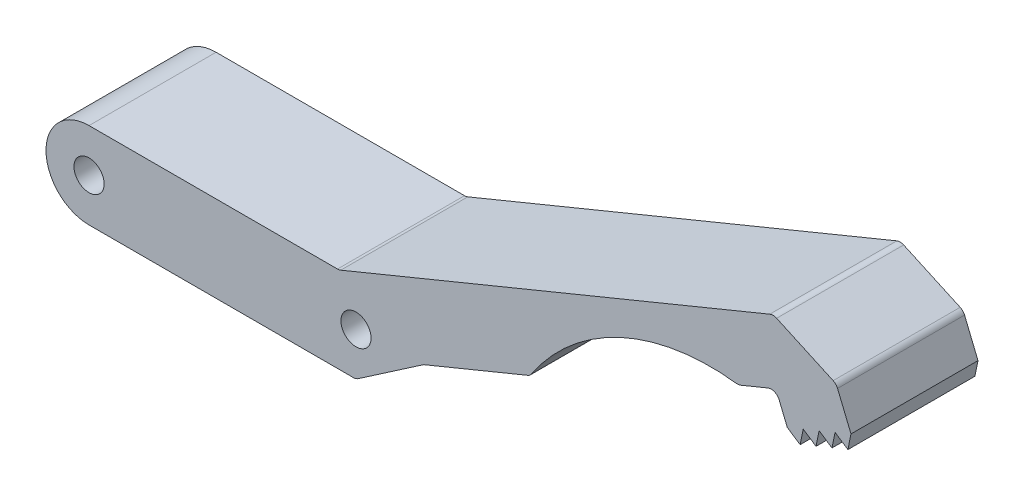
ISO-10303-21;
HEADER;
FILE_DESCRIPTION(('STEP AP214'),'2;1');
FILE_NAME('part.step','',(''),(''),'','','');
FILE_SCHEMA(('AUTOMOTIVE_DESIGN { 1 0 10303 214 1 1 1 1 }'));
ENDSEC;
DATA;
#1=APPLICATION_CONTEXT('core data for automotive mechanical design processes');
#2=APPLICATION_PROTOCOL_DEFINITION('international standard','automotive_design',2000,#1);
#3=PRODUCT_CONTEXT('',#1,'mechanical');
#4=PRODUCT('Part','Part','',(#3));
#5=PRODUCT_RELATED_PRODUCT_CATEGORY('part','',(#4));
#6=PRODUCT_DEFINITION_FORMATION('','',#4);
#7=PRODUCT_DEFINITION_CONTEXT('part definition',#1,'design');
#8=PRODUCT_DEFINITION('design','',#6,#7);
#9=PRODUCT_DEFINITION_SHAPE('','',#8);
#10=(LENGTH_UNIT() NAMED_UNIT(*) SI_UNIT(.MILLI.,.METRE.));
#11=(NAMED_UNIT(*) PLANE_ANGLE_UNIT() SI_UNIT($,.RADIAN.));
#12=(NAMED_UNIT(*) SI_UNIT($,.STERADIAN.) SOLID_ANGLE_UNIT());
#13=UNCERTAINTY_MEASURE_WITH_UNIT(LENGTH_MEASURE(1.E-05),#10,'distance_accuracy_value','');
#14=(GEOMETRIC_REPRESENTATION_CONTEXT(3) GLOBAL_UNCERTAINTY_ASSIGNED_CONTEXT((#13)) GLOBAL_UNIT_ASSIGNED_CONTEXT((#10,
#11,#12)) REPRESENTATION_CONTEXT('',''));
#15=CARTESIAN_POINT('',(0.,0.,0.));
#16=DIRECTION('',(0.,0.,1.));
#17=DIRECTION('',(1.,0.,0.));
#18=AXIS2_PLACEMENT_3D('',#15,#16,#17);
#19=CARTESIAN_POINT('',(4.18285581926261,-10.1735590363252,7.375));
#20=DIRECTION('',(0.380263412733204,-0.92487822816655,0.));
#21=DIRECTION('',(0.92487822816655,0.380263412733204,0.));
#22=AXIS2_PLACEMENT_3D('',#19,#20,#21);
#23=PLANE('',#22);
#24=DIRECTION('',(-0.92487822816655,-0.380263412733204,0.));
#25=VECTOR('',#24,1.);
#26=CARTESIAN_POINT('',(4.18285581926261,-10.1735590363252,-7.375));
#27=LINE('',#26,#25);
#28=CARTESIAN_POINT('',(41.9373455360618,5.34918835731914,-7.375));
#29=VERTEX_POINT('',#28);
#30=CARTESIAN_POINT('',(29.9516692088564,0.421281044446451,-7.375));
#31=VERTEX_POINT('',#30);
#32=EDGE_CURVE('E298',#29,#31,#27,.T.);
#33=ORIENTED_EDGE('',*,*,#32,.F.);
#34=DIRECTION('',(0.,0.,1.));
#35=VECTOR('',#34,1.);
#36=CARTESIAN_POINT('',(41.9373455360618,5.34918835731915,7.375));
#37=LINE('',#36,#35);
#38=CARTESIAN_POINT('',(41.9373455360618,5.34918835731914,7.375));
#39=VERTEX_POINT('',#38);
#40=EDGE_CURVE('E406',#29,#39,#37,.T.);
#41=ORIENTED_EDGE('',*,*,#40,.T.);
#42=DIRECTION('',(-0.92487822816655,-0.380263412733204,0.));
#43=VECTOR('',#42,1.);
#44=CARTESIAN_POINT('',(4.18285581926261,-10.1735590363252,7.375));
#45=LINE('',#44,#43);
#46=CARTESIAN_POINT('',(29.9516692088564,0.421281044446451,7.375));
#47=VERTEX_POINT('',#46);
#48=EDGE_CURVE('E446',#39,#47,#45,.T.);
#49=ORIENTED_EDGE('',*,*,#48,.T.);
#50=DIRECTION('',(0.,0.,-1.));
#51=VECTOR('',#50,1.);
#52=CARTESIAN_POINT('',(29.9516692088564,0.421281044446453,-7.375));
#53=LINE('',#52,#51);
#54=EDGE_CURVE('E403',#47,#31,#53,.T.);
#55=ORIENTED_EDGE('',*,*,#54,.T.);
#56=EDGE_LOOP('',(#33,#41,#49,#55));
#57=FACE_BOUND('',#56,.T.);
#58=ADVANCED_FACE('F41',(#57),#23,.T.);
#59=CARTESIAN_POINT('',(63.1527344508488,-8.10069108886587,7.375));
#60=DIRECTION('',(0.,0.,-1.));
#61=DIRECTION('',(-1.,0.,0.));
#62=AXIS2_PLACEMENT_3D('',#59,#60,#61);
#63=CYLINDRICAL_SURFACE('',#62,24.9423564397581);
#64=CARTESIAN_POINT('',(63.1527344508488,-8.10069108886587,-7.375));
#65=DIRECTION('',(0.,0.,1.));
#66=DIRECTION('',(1.,0.,0.));
#67=AXIS2_PLACEMENT_3D('',#64,#65,#66);
#68=CIRCLE('',#67,24.9423564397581);
#69=CARTESIAN_POINT('',(42.3895297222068,5.71996280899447,-7.375));
#70=VERTEX_POINT('',#69);
#71=CARTESIAN_POINT('',(66.1728326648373,16.6581487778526,-7.375));
#72=VERTEX_POINT('',#71);
#73=EDGE_CURVE('E301',#70,#72,#68,.F.);
#74=ORIENTED_EDGE('',*,*,#73,.T.);
#75=DIRECTION('',(0.,0.,-1.));
#76=VECTOR('',#75,1.);
#77=CARTESIAN_POINT('',(66.1728326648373,16.6581487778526,7.375));
#78=LINE('',#77,#76);
#79=CARTESIAN_POINT('',(66.1728326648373,16.6581487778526,7.375));
#80=VERTEX_POINT('',#79);
#81=EDGE_CURVE('E390',#72,#80,#78,.F.);
#82=ORIENTED_EDGE('',*,*,#81,.T.);
#83=CARTESIAN_POINT('',(63.1527344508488,-8.10069108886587,7.375));
#84=DIRECTION('',(0.,0.,1.));
#85=DIRECTION('',(1.,0.,0.));
#86=AXIS2_PLACEMENT_3D('',#83,#84,#85);
#87=CIRCLE('',#86,24.9423564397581);
#88=CARTESIAN_POINT('',(42.3895297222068,5.71996280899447,7.375));
#89=VERTEX_POINT('',#88);
#90=EDGE_CURVE('E251',#89,#80,#87,.F.);
#91=ORIENTED_EDGE('',*,*,#90,.F.);
#92=DIRECTION('',(0.,0.,-1.));
#93=VECTOR('',#92,1.);
#94=CARTESIAN_POINT('',(42.3895297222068,5.71996280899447,7.375));
#95=LINE('',#94,#93);
#96=EDGE_CURVE('E387',#89,#70,#95,.T.);
#97=ORIENTED_EDGE('',*,*,#96,.T.);
#98=EDGE_LOOP('',(#74,#82,#91,#97));
#99=FACE_BOUND('',#98,.T.);
#100=ADVANCED_FACE('F485',(#99),#63,.F.);
#101=CARTESIAN_POINT('',(3.75864457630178,-9.14179071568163,7.375));
#102=DIRECTION('',(0.380263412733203,-0.924878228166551,0.));
#103=DIRECTION('',(0.924878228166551,0.380263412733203,0.));
#104=AXIS2_PLACEMENT_3D('',#101,#102,#103);
#105=PLANE('',#104);
#106=DIRECTION('',(-0.924878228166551,-0.380263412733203,0.));
#107=VECTOR('',#106,1.);
#108=CARTESIAN_POINT('',(3.75864457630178,-9.14179071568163,7.375));
#109=LINE('',#108,#107);
#110=CARTESIAN_POINT('',(69.8366856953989,18.0261765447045,7.375));
#111=VERTEX_POINT('',#110);
#112=CARTESIAN_POINT('',(66.6741791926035,16.7259129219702,7.375));
#113=VERTEX_POINT('',#112);
#114=EDGE_CURVE('E248',#111,#113,#109,.T.);
#115=ORIENTED_EDGE('',*,*,#114,.T.);
#116=DIRECTION('',(0.,0.,1.));
#117=VECTOR('',#116,1.);
#118=CARTESIAN_POINT('',(66.6741791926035,16.7259129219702,-7.375));
#119=LINE('',#118,#117);
#120=CARTESIAN_POINT('',(66.6741791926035,16.7259129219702,-7.375));
#121=VERTEX_POINT('',#120);
#122=EDGE_CURVE('E374',#113,#121,#119,.F.);
#123=ORIENTED_EDGE('',*,*,#122,.T.);
#124=DIRECTION('',(-0.924878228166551,-0.380263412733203,0.));
#125=VECTOR('',#124,1.);
#126=CARTESIAN_POINT('',(3.75864457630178,-9.14179071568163,-7.375));
#127=LINE('',#126,#125);
#128=CARTESIAN_POINT('',(69.8366856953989,18.0261765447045,-7.375));
#129=VERTEX_POINT('',#128);
#130=EDGE_CURVE('E304',#129,#121,#127,.T.);
#131=ORIENTED_EDGE('',*,*,#130,.F.);
#132=DIRECTION('',(0.,0.,-1.));
#133=VECTOR('',#132,1.);
#134=CARTESIAN_POINT('',(69.8366856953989,18.0261765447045,7.375));
#135=LINE('',#134,#133);
#136=EDGE_CURVE('E233',#129,#111,#135,.F.);
#137=ORIENTED_EDGE('',*,*,#136,.T.);
#138=EDGE_LOOP('',(#115,#123,#131,#137));
#139=FACE_BOUND('',#138,.T.);
#140=ADVANCED_FACE('F490',(#139),#105,.T.);
#141=CARTESIAN_POINT('',(67.0029193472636,27.5482306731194,7.375));
#142=DIRECTION('',(-0.92487822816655,-0.380263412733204,0.));
#143=DIRECTION('',(0.380263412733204,-0.92487822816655,0.));
#144=AXIS2_PLACEMENT_3D('',#141,#142,#143);
#145=PLANE('',#144);
#146=DIRECTION('',(-0.380263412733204,0.92487822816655,0.));
#147=VECTOR('',#146,1.);
#148=CARTESIAN_POINT('',(67.0029193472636,27.5482306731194,7.375));
#149=LINE('',#148,#147);
#150=CARTESIAN_POINT('',(72.0850784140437,15.1873825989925,7.375));
#151=VERTEX_POINT('',#150);
#152=CARTESIAN_POINT('',(71.1418273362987,17.4815617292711,7.375));
#153=VERTEX_POINT('',#152);
#154=EDGE_CURVE('E226',#151,#153,#149,.T.);
#155=ORIENTED_EDGE('',*,*,#154,.T.);
#156=DIRECTION('',(0.,0.,-1.));
#157=VECTOR('',#156,1.);
#158=CARTESIAN_POINT('',(71.1418273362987,17.4815617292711,-7.375));
#159=LINE('',#158,#157);
#160=CARTESIAN_POINT('',(71.1418273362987,17.4815617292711,-7.375));
#161=VERTEX_POINT('',#160);
#162=EDGE_CURVE('E401',#153,#161,#159,.T.);
#163=ORIENTED_EDGE('',*,*,#162,.T.);
#164=DIRECTION('',(-0.380263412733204,0.92487822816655,0.));
#165=VECTOR('',#164,1.);
#166=CARTESIAN_POINT('',(67.0029193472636,27.5482306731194,-7.375));
#167=LINE('',#166,#165);
#168=CARTESIAN_POINT('',(72.0850784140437,15.1873825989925,-7.375));
#169=VERTEX_POINT('',#168);
#170=EDGE_CURVE('E229',#169,#161,#167,.T.);
#171=ORIENTED_EDGE('',*,*,#170,.F.);
#172=DIRECTION('',(0.,0.,-1.));
#173=VECTOR('',#172,1.);
#174=CARTESIAN_POINT('',(72.0850784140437,15.1873825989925,7.375));
#175=LINE('',#174,#173);
#176=EDGE_CURVE('E221',#151,#169,#175,.T.);
#177=ORIENTED_EDGE('',*,*,#176,.F.);
#178=EDGE_LOOP('',(#155,#163,#171,#177));
#179=FACE_BOUND('',#178,.T.);
#180=ADVANCED_FACE('F223',(#179),#145,.T.);
#181=CARTESIAN_POINT('',(29.2503710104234,43.795835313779,7.375));
#182=DIRECTION('',(0.555398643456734,0.831584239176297,0.));
#183=DIRECTION('',(-0.831584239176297,0.555398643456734,0.));
#184=AXIS2_PLACEMENT_3D('',#181,#182,#183);
#185=PLANE('',#184);
#186=DIRECTION('',(0.831584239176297,-0.555398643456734,0.));
#187=VECTOR('',#186,1.);
#188=CARTESIAN_POINT('',(29.2503710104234,43.795835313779,-7.375));
#189=LINE('',#188,#187);
#190=CARTESIAN_POINT('',(73.5755961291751,14.1918953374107,-7.375));
#191=VERTEX_POINT('',#190);
#192=EDGE_CURVE('E308',#169,#191,#189,.T.);
#193=ORIENTED_EDGE('',*,*,#192,.T.);
#194=DIRECTION('',(0.,0.,-1.));
#195=VECTOR('',#194,1.);
#196=CARTESIAN_POINT('',(73.5755961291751,14.1918953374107,7.375));
#197=LINE('',#196,#195);
#198=CARTESIAN_POINT('',(73.5755961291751,14.1918953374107,7.375));
#199=VERTEX_POINT('',#198);
#200=EDGE_CURVE('E234',#199,#191,#197,.T.);
#201=ORIENTED_EDGE('',*,*,#200,.F.);
#202=DIRECTION('',(0.831584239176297,-0.555398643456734,0.));
#203=VECTOR('',#202,1.);
#204=CARTESIAN_POINT('',(29.2503710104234,43.795835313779,7.375));
#205=LINE('',#204,#203);
#206=EDGE_CURVE('E238',#151,#199,#205,.T.);
#207=ORIENTED_EDGE('',*,*,#206,.F.);
#208=ORIENTED_EDGE('',*,*,#176,.T.);
#209=EDGE_LOOP('',(#193,#201,#207,#208));
#210=FACE_BOUND('',#209,.T.);
#211=ADVANCED_FACE('F239',(#210),#185,.F.);
#212=CARTESIAN_POINT('',(67.8333487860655,-13.8770907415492,7.375));
#213=DIRECTION('',(-0.979709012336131,0.200425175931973,0.));
#214=DIRECTION('',(-0.200425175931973,-0.979709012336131,0.));
#215=AXIS2_PLACEMENT_3D('',#212,#213,#214);
#216=PLANE('',#215);
#217=DIRECTION('',(0.200425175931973,0.979709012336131,0.));
#218=VECTOR('',#217,1.);
#219=CARTESIAN_POINT('',(67.8333487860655,-13.8770907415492,-7.375));
#220=LINE('',#219,#218);
#221=CARTESIAN_POINT('',(73.9348348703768,15.9479094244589,-7.375));
#222=VERTEX_POINT('',#221);
#223=EDGE_CURVE('E310',#191,#222,#220,.T.);
#224=ORIENTED_EDGE('',*,*,#223,.T.);
#225=DIRECTION('',(0.,0.,-1.));
#226=VECTOR('',#225,1.);
#227=CARTESIAN_POINT('',(73.9348348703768,15.9479094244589,7.375));
#228=LINE('',#227,#226);
#229=CARTESIAN_POINT('',(73.9348348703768,15.9479094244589,7.375));
#230=VERTEX_POINT('',#229);
#231=EDGE_CURVE('E370',#230,#222,#228,.T.);
#232=ORIENTED_EDGE('',*,*,#231,.F.);
#233=DIRECTION('',(0.200425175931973,0.979709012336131,0.));
#234=VECTOR('',#233,1.);
#235=CARTESIAN_POINT('',(67.8333487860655,-13.8770907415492,7.375));
#236=LINE('',#235,#234);
#237=EDGE_CURVE('E241',#199,#230,#236,.T.);
#238=ORIENTED_EDGE('',*,*,#237,.F.);
#239=ORIENTED_EDGE('',*,*,#200,.T.);
#240=EDGE_LOOP('',(#224,#232,#238,#239));
#241=FACE_BOUND('',#240,.T.);
#242=ADVANCED_FACE('F581',(#241),#216,.F.);
#243=CARTESIAN_POINT('',(30.1722185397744,45.1760941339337,7.375));
#244=DIRECTION('',(-0.555398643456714,-0.83158423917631,0.));
#245=DIRECTION('',(0.83158423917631,-0.555398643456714,0.));
#246=AXIS2_PLACEMENT_3D('',#243,#244,#245);
#247=PLANE('',#246);
#248=DIRECTION('',(-0.83158423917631,0.555398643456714,0.));
#249=VECTOR('',#248,1.);
#250=CARTESIAN_POINT('',(30.1722185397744,45.1760941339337,-7.375));
#251=LINE('',#250,#249);
#252=CARTESIAN_POINT('',(75.4253525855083,14.9524221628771,-7.375));
#253=VERTEX_POINT('',#252);
#254=EDGE_CURVE('E313',#253,#222,#251,.T.);
#255=ORIENTED_EDGE('',*,*,#254,.F.);
#256=DIRECTION('',(0.,0.,-1.));
#257=VECTOR('',#256,1.);
#258=CARTESIAN_POINT('',(75.4253525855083,14.9524221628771,7.375));
#259=LINE('',#258,#257);
#260=CARTESIAN_POINT('',(75.4253525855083,14.9524221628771,7.375));
#261=VERTEX_POINT('',#260);
#262=EDGE_CURVE('E368',#261,#253,#259,.T.);
#263=ORIENTED_EDGE('',*,*,#262,.F.);
#264=DIRECTION('',(-0.83158423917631,0.555398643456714,0.));
#265=VECTOR('',#264,1.);
#266=CARTESIAN_POINT('',(30.1722185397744,45.1760941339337,7.375));
#267=LINE('',#266,#265);
#268=EDGE_CURVE('E256',#261,#230,#267,.T.);
#269=ORIENTED_EDGE('',*,*,#268,.T.);
#270=ORIENTED_EDGE('',*,*,#231,.T.);
#271=EDGE_LOOP('',(#255,#263,#269,#270));
#272=FACE_BOUND('',#271,.T.);
#273=ADVANCED_FACE('F578',(#272),#247,.T.);
#274=CARTESIAN_POINT('',(69.4594642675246,-14.209755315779,7.375));
#275=DIRECTION('',(0.979709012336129,-0.200425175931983,0.));
#276=DIRECTION('',(0.200425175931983,0.979709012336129,0.));
#277=AXIS2_PLACEMENT_3D('',#274,#275,#276);
#278=PLANE('',#277);
#279=DIRECTION('',(-0.200425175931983,-0.979709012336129,0.));
#280=VECTOR('',#279,1.);
#281=CARTESIAN_POINT('',(69.4594642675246,-14.209755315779,-7.375));
#282=LINE('',#281,#280);
#283=CARTESIAN_POINT('',(75.78459132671,16.7084362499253,-7.375));
#284=VERTEX_POINT('',#283);
#285=EDGE_CURVE('E316',#284,#253,#282,.T.);
#286=ORIENTED_EDGE('',*,*,#285,.F.);
#287=DIRECTION('',(0.,0.,-1.));
#288=VECTOR('',#287,1.);
#289=CARTESIAN_POINT('',(75.78459132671,16.7084362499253,7.375));
#290=LINE('',#289,#288);
#291=CARTESIAN_POINT('',(75.78459132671,16.7084362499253,7.375));
#292=VERTEX_POINT('',#291);
#293=EDGE_CURVE('E366',#292,#284,#290,.T.);
#294=ORIENTED_EDGE('',*,*,#293,.F.);
#295=DIRECTION('',(-0.200425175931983,-0.979709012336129,0.));
#296=VECTOR('',#295,1.);
#297=CARTESIAN_POINT('',(69.4594642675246,-14.209755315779,7.375));
#298=LINE('',#297,#296);
#299=EDGE_CURVE('E259',#292,#261,#298,.T.);
#300=ORIENTED_EDGE('',*,*,#299,.T.);
#301=ORIENTED_EDGE('',*,*,#262,.T.);
#302=EDGE_LOOP('',(#286,#294,#300,#301));
#303=FACE_BOUND('',#302,.T.);
#304=ADVANCED_FACE('F573',(#303),#278,.T.);
#305=CARTESIAN_POINT('',(31.0940660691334,46.5563529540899,7.375));
#306=DIRECTION('',(0.555398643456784,0.831584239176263,0.));
#307=DIRECTION('',(-0.831584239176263,0.555398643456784,0.));
#308=AXIS2_PLACEMENT_3D('',#305,#306,#307);
#309=PLANE('',#308);
#310=DIRECTION('',(0.831584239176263,-0.555398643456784,0.));
#311=VECTOR('',#310,1.);
#312=CARTESIAN_POINT('',(31.0940660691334,46.5563529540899,-7.375));
#313=LINE('',#312,#311);
#314=CARTESIAN_POINT('',(77.2751090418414,15.7129489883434,-7.375));
#315=VERTEX_POINT('',#314);
#316=EDGE_CURVE('E319',#284,#315,#313,.T.);
#317=ORIENTED_EDGE('',*,*,#316,.T.);
#318=DIRECTION('',(0.,0.,-1.));
#319=VECTOR('',#318,1.);
#320=CARTESIAN_POINT('',(77.2751090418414,15.7129489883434,7.375));
#321=LINE('',#320,#319);
#322=CARTESIAN_POINT('',(77.2751090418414,15.7129489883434,7.375));
#323=VERTEX_POINT('',#322);
#324=EDGE_CURVE('E363',#323,#315,#321,.T.);
#325=ORIENTED_EDGE('',*,*,#324,.F.);
#326=DIRECTION('',(0.831584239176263,-0.555398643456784,0.));
#327=VECTOR('',#326,1.);
#328=CARTESIAN_POINT('',(31.0940660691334,46.5563529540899,7.375));
#329=LINE('',#328,#327);
#330=EDGE_CURVE('E262',#292,#323,#329,.T.);
#331=ORIENTED_EDGE('',*,*,#330,.F.);
#332=ORIENTED_EDGE('',*,*,#293,.T.);
#333=EDGE_LOOP('',(#317,#325,#331,#332));
#334=FACE_BOUND('',#333,.T.);
#335=ADVANCED_FACE('F570',(#334),#309,.F.);
#336=CARTESIAN_POINT('',(71.0855797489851,-14.5424198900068,7.375));
#337=DIRECTION('',(-0.979709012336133,0.200425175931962,0.));
#338=DIRECTION('',(-0.200425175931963,-0.979709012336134,0.));
#339=AXIS2_PLACEMENT_3D('',#336,#337,#338);
#340=PLANE('',#339);
#341=DIRECTION('',(0.200425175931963,0.979709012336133,0.));
#342=VECTOR('',#341,1.);
#343=CARTESIAN_POINT('',(71.0855797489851,-14.5424198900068,-7.375));
#344=LINE('',#343,#342);
#345=CARTESIAN_POINT('',(77.6343477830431,17.4689630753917,-7.375));
#346=VERTEX_POINT('',#345);
#347=EDGE_CURVE('E322',#315,#346,#344,.T.);
#348=ORIENTED_EDGE('',*,*,#347,.T.);
#349=DIRECTION('',(0.,0.,-1.));
#350=VECTOR('',#349,1.);
#351=CARTESIAN_POINT('',(77.6343477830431,17.4689630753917,7.375));
#352=LINE('',#351,#350);
#353=CARTESIAN_POINT('',(77.6343477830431,17.4689630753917,7.375));
#354=VERTEX_POINT('',#353);
#355=EDGE_CURVE('E361',#354,#346,#352,.T.);
#356=ORIENTED_EDGE('',*,*,#355,.F.);
#357=DIRECTION('',(0.200425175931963,0.979709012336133,0.));
#358=VECTOR('',#357,1.);
#359=CARTESIAN_POINT('',(71.0855797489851,-14.5424198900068,7.375));
#360=LINE('',#359,#358);
#361=EDGE_CURVE('E265',#323,#354,#360,.T.);
#362=ORIENTED_EDGE('',*,*,#361,.F.);
#363=ORIENTED_EDGE('',*,*,#324,.T.);
#364=EDGE_LOOP('',(#348,#356,#362,#363));
#365=FACE_BOUND('',#364,.T.);
#366=ADVANCED_FACE('F566',(#365),#340,.F.);
#367=CARTESIAN_POINT('',(32.0159135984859,47.9366117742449,7.375));
#368=DIRECTION('',(-0.555398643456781,-0.831584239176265,0.));
#369=DIRECTION('',(0.831584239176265,-0.555398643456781,0.));
#370=AXIS2_PLACEMENT_3D('',#367,#368,#369);
#371=PLANE('',#370);
#372=DIRECTION('',(-0.831584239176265,0.555398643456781,0.));
#373=VECTOR('',#372,1.);
#374=CARTESIAN_POINT('',(32.0159135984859,47.9366117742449,-7.375));
#375=LINE('',#374,#373);
#376=CARTESIAN_POINT('',(79.1248654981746,16.4734758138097,-7.375));
#377=VERTEX_POINT('',#376);
#378=EDGE_CURVE('E325',#377,#346,#375,.T.);
#379=ORIENTED_EDGE('',*,*,#378,.F.);
#380=DIRECTION('',(0.,0.,-1.));
#381=VECTOR('',#380,1.);
#382=CARTESIAN_POINT('',(79.1248654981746,16.4734758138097,7.375));
#383=LINE('',#382,#381);
#384=CARTESIAN_POINT('',(79.1248654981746,16.4734758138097,7.375));
#385=VERTEX_POINT('',#384);
#386=EDGE_CURVE('E359',#385,#377,#383,.T.);
#387=ORIENTED_EDGE('',*,*,#386,.F.);
#388=DIRECTION('',(-0.831584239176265,0.555398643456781,0.));
#389=VECTOR('',#388,1.);
#390=CARTESIAN_POINT('',(32.0159135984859,47.9366117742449,7.375));
#391=LINE('',#390,#389);
#392=EDGE_CURVE('E267',#385,#354,#391,.T.);
#393=ORIENTED_EDGE('',*,*,#392,.T.);
#394=ORIENTED_EDGE('',*,*,#355,.T.);
#395=EDGE_LOOP('',(#379,#387,#393,#394));
#396=FACE_BOUND('',#395,.T.);
#397=ADVANCED_FACE('F562',(#396),#371,.T.);
#398=CARTESIAN_POINT('',(72.7116952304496,-14.8750844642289,7.375));
#399=DIRECTION('',(0.979709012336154,-0.200425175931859,0.));
#400=DIRECTION('',(0.200425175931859,0.979709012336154,0.));
#401=AXIS2_PLACEMENT_3D('',#398,#399,#400);
#402=PLANE('',#401);
#403=DIRECTION('',(-0.200425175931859,-0.979709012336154,0.));
#404=VECTOR('',#403,1.);
#405=CARTESIAN_POINT('',(72.7116952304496,-14.8750844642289,-7.375));
#406=LINE('',#405,#404);
#407=CARTESIAN_POINT('',(79.4841042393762,18.2294899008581,-7.375));
#408=VERTEX_POINT('',#407);
#409=EDGE_CURVE('E328',#408,#377,#406,.T.);
#410=ORIENTED_EDGE('',*,*,#409,.F.);
#411=DIRECTION('',(0.,0.,-1.));
#412=VECTOR('',#411,1.);
#413=CARTESIAN_POINT('',(79.4841042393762,18.2294899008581,7.375));
#414=LINE('',#413,#412);
#415=CARTESIAN_POINT('',(79.4841042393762,18.2294899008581,7.375));
#416=VERTEX_POINT('',#415);
#417=EDGE_CURVE('E356',#416,#408,#414,.T.);
#418=ORIENTED_EDGE('',*,*,#417,.F.);
#419=DIRECTION('',(-0.200425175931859,-0.979709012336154,0.));
#420=VECTOR('',#419,1.);
#421=CARTESIAN_POINT('',(72.7116952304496,-14.8750844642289,7.375));
#422=LINE('',#421,#420);
#423=EDGE_CURVE('E270',#416,#385,#422,.T.);
#424=ORIENTED_EDGE('',*,*,#423,.T.);
#425=ORIENTED_EDGE('',*,*,#386,.T.);
#426=EDGE_LOOP('',(#410,#418,#424,#425));
#427=FACE_BOUND('',#426,.T.);
#428=ADVANCED_FACE('F558',(#427),#402,.T.);
#429=CARTESIAN_POINT('',(74.4019451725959,30.5903379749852,7.375));
#430=DIRECTION('',(0.924878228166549,0.380263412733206,0.));
#431=DIRECTION('',(-0.380263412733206,0.924878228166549,0.));
#432=AXIS2_PLACEMENT_3D('',#429,#430,#431);
#433=PLANE('',#432);
#434=DIRECTION('',(0.380263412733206,-0.924878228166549,0.));
#435=VECTOR('',#434,1.);
#436=CARTESIAN_POINT('',(74.4019451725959,30.5903379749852,-7.375));
#437=LINE('',#436,#435);
#438=CARTESIAN_POINT('',(77.9233252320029,22.0256229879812,-7.375));
#439=VERTEX_POINT('',#438);
#440=EDGE_CURVE('E331',#439,#408,#437,.T.);
#441=ORIENTED_EDGE('',*,*,#440,.F.);
#442=DIRECTION('',(0.,0.,-1.));
#443=VECTOR('',#442,1.);
#444=CARTESIAN_POINT('',(77.9233252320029,22.0256229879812,7.375));
#445=LINE('',#444,#443);
#446=CARTESIAN_POINT('',(77.9233252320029,22.0256229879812,7.375));
#447=VERTEX_POINT('',#446);
#448=EDGE_CURVE('E421',#439,#447,#445,.F.);
#449=ORIENTED_EDGE('',*,*,#448,.T.);
#450=DIRECTION('',(0.380263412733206,-0.924878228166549,0.));
#451=VECTOR('',#450,1.);
#452=CARTESIAN_POINT('',(74.4019451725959,30.5903379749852,7.375));
#453=LINE('',#452,#451);
#454=EDGE_CURVE('E273',#447,#416,#453,.T.);
#455=ORIENTED_EDGE('',*,*,#454,.T.);
#456=ORIENTED_EDGE('',*,*,#417,.T.);
#457=EDGE_LOOP('',(#441,#449,#455,#456));
#458=FACE_BOUND('',#457,.T.);
#459=ADVANCED_FACE('F552',(#458),#433,.T.);
#460=CARTESIAN_POINT('',(21.8103769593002,47.8823439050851,7.375));
#461=DIRECTION('',(0.414522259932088,0.910039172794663,0.));
#462=DIRECTION('',(-0.910039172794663,0.414522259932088,0.));
#463=AXIS2_PLACEMENT_3D('',#460,#461,#462);
#464=PLANE('',#463);
#465=DIRECTION('',(0.910039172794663,-0.414522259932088,0.));
#466=VECTOR('',#465,1.);
#467=CARTESIAN_POINT('',(21.8103769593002,47.8823439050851,7.375));
#468=LINE('',#467,#466);
#469=CARTESIAN_POINT('',(70.8500425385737,25.54480766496,7.375));
#470=VERTEX_POINT('',#469);
#471=CARTESIAN_POINT('',(77.4129692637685,22.5553987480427,7.375));
#472=VERTEX_POINT('',#471);
#473=EDGE_CURVE('E275',#470,#472,#468,.T.);
#474=ORIENTED_EDGE('',*,*,#473,.T.);
#475=DIRECTION('',(0.,0.,-1.));
#476=VECTOR('',#475,1.);
#477=CARTESIAN_POINT('',(77.4129692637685,22.5553987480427,7.375));
#478=LINE('',#477,#476);
#479=CARTESIAN_POINT('',(77.4129692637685,22.5553987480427,-7.375));
#480=VERTEX_POINT('',#479);
#481=EDGE_CURVE('E418',#472,#480,#478,.T.);
#482=ORIENTED_EDGE('',*,*,#481,.T.);
#483=DIRECTION('',(0.910039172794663,-0.414522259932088,0.));
#484=VECTOR('',#483,1.);
#485=CARTESIAN_POINT('',(21.8103769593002,47.8823439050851,-7.375));
#486=LINE('',#485,#484);
#487=CARTESIAN_POINT('',(70.8500425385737,25.54480766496,-7.375));
#488=VERTEX_POINT('',#487);
#489=EDGE_CURVE('E333',#488,#480,#486,.T.);
#490=ORIENTED_EDGE('',*,*,#489,.F.);
#491=DIRECTION('',(0.,0.,-1.));
#492=VECTOR('',#491,1.);
#493=CARTESIAN_POINT('',(70.8500425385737,25.54480766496,7.375));
#494=LINE('',#493,#492);
#495=EDGE_CURVE('E416',#488,#470,#494,.F.);
#496=ORIENTED_EDGE('',*,*,#495,.T.);
#497=EDGE_LOOP('',(#474,#482,#490,#496));
#498=FACE_BOUND('',#497,.T.);
#499=ADVANCED_FACE('F545',(#498),#464,.T.);
#500=CARTESIAN_POINT('',(1.14074851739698,-2.7745332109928,7.375));
#501=DIRECTION('',(-0.380263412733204,0.92487822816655,0.));
#502=DIRECTION('',(-0.92487822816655,-0.380263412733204,0.));
#503=AXIS2_PLACEMENT_3D('',#500,#501,#502);
#504=PLANE('',#503);
#505=DIRECTION('',(0.92487822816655,0.380263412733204,0.));
#506=VECTOR('',#505,1.);
#507=CARTESIAN_POINT('',(1.14074851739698,-2.7745332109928,-7.375));
#508=LINE('',#507,#506);
#509=CARTESIAN_POINT('',(20.2327114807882,5.07512177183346,-7.375));
#510=VERTEX_POINT('',#509);
#511=CARTESIAN_POINT('',(70.0552568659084,25.5596467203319,-7.375));
#512=VERTEX_POINT('',#511);
#513=EDGE_CURVE('E336',#510,#512,#508,.T.);
#514=ORIENTED_EDGE('',*,*,#513,.F.);
#515=DIRECTION('',(0.,0.,-1.));
#516=VECTOR('',#515,1.);
#517=CARTESIAN_POINT('',(20.2327114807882,5.07512177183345,7.375));
#518=LINE('',#517,#516);
#519=CARTESIAN_POINT('',(20.2327114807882,5.07512177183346,7.375));
#520=VERTEX_POINT('',#519);
#521=EDGE_CURVE('E414',#510,#520,#518,.F.);
#522=ORIENTED_EDGE('',*,*,#521,.T.);
#523=DIRECTION('',(0.92487822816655,0.380263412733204,0.));
#524=VECTOR('',#523,1.);
#525=CARTESIAN_POINT('',(1.14074851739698,-2.7745332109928,7.375));
#526=LINE('',#525,#524);
#527=CARTESIAN_POINT('',(70.0552568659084,25.5596467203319,7.375));
#528=VERTEX_POINT('',#527);
#529=EDGE_CURVE('E278',#520,#528,#526,.T.);
#530=ORIENTED_EDGE('',*,*,#529,.T.);
#531=DIRECTION('',(0.,0.,-1.));
#532=VECTOR('',#531,1.);
#533=CARTESIAN_POINT('',(70.0552568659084,25.5596467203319,7.375));
#534=LINE('',#533,#532);
#535=EDGE_CURVE('E411',#528,#512,#534,.T.);
#536=ORIENTED_EDGE('',*,*,#535,.T.);
#537=EDGE_LOOP('',(#514,#522,#530,#536));
#538=FACE_BOUND('',#537,.T.);
#539=ADVANCED_FACE('F538',(#538),#504,.T.);
#540=CARTESIAN_POINT('',(0.,5.,7.375));
#541=DIRECTION('',(0.,1.,0.));
#542=DIRECTION('',(-1.,0.,0.));
#543=AXIS2_PLACEMENT_3D('',#540,#541,#542);
#544=PLANE('',#543);
#545=DIRECTION('',(1.,0.,0.));
#546=VECTOR('',#545,1.);
#547=CARTESIAN_POINT('',(0.,5.,7.375));
#548=LINE('',#547,#546);
#549=CARTESIAN_POINT('',(-9.,5.,7.375));
#550=VERTEX_POINT('',#549);
#551=CARTESIAN_POINT('',(19.852448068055,5.,7.375));
#552=VERTEX_POINT('',#551);
#553=EDGE_CURVE('E281',#550,#552,#548,.T.);
#554=ORIENTED_EDGE('',*,*,#553,.T.);
#555=DIRECTION('',(0.,0.,-1.));
#556=VECTOR('',#555,1.);
#557=CARTESIAN_POINT('',(19.852448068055,5.,-7.375));
#558=LINE('',#557,#556);
#559=CARTESIAN_POINT('',(19.852448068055,5.,-7.375));
#560=VERTEX_POINT('',#559);
#561=EDGE_CURVE('E408',#552,#560,#558,.T.);
#562=ORIENTED_EDGE('',*,*,#561,.T.);
#563=DIRECTION('',(1.,0.,0.));
#564=VECTOR('',#563,1.);
#565=CARTESIAN_POINT('',(0.,5.,-7.375));
#566=LINE('',#565,#564);
#567=CARTESIAN_POINT('',(-9.,5.,-7.375));
#568=VERTEX_POINT('',#567);
#569=EDGE_CURVE('E339',#568,#560,#566,.T.);
#570=ORIENTED_EDGE('',*,*,#569,.F.);
#571=DIRECTION('',(0.,0.,-1.));
#572=VECTOR('',#571,1.);
#573=CARTESIAN_POINT('',(-9.,5.,7.375));
#574=LINE('',#573,#572);
#575=EDGE_CURVE('E354',#550,#568,#574,.T.);
#576=ORIENTED_EDGE('',*,*,#575,.F.);
#577=EDGE_LOOP('',(#554,#562,#570,#576));
#578=FACE_BOUND('',#577,.T.);
#579=ADVANCED_FACE('F531',(#578),#544,.T.);
#580=CARTESIAN_POINT('',(-9.,0.,7.375));
#581=DIRECTION('',(0.,0.,-1.));
#582=DIRECTION('',(-1.,0.,0.));
#583=AXIS2_PLACEMENT_3D('',#580,#581,#582);
#584=CYLINDRICAL_SURFACE('',#583,5.);
#585=CARTESIAN_POINT('',(-9.,0.,-7.375));
#586=DIRECTION('',(0.,0.,1.));
#587=DIRECTION('',(1.,0.,0.));
#588=AXIS2_PLACEMENT_3D('',#585,#586,#587);
#589=CIRCLE('',#588,5.);
#590=CARTESIAN_POINT('',(-9.,-5.,-7.375));
#591=VERTEX_POINT('',#590);
#592=EDGE_CURVE('E342',#568,#591,#589,.T.);
#593=ORIENTED_EDGE('',*,*,#592,.T.);
#594=DIRECTION('',(0.,0.,-1.));
#595=VECTOR('',#594,1.);
#596=CARTESIAN_POINT('',(-9.,-5.,7.375));
#597=LINE('',#596,#595);
#598=CARTESIAN_POINT('',(-9.,-5.,7.375));
#599=VERTEX_POINT('',#598);
#600=EDGE_CURVE('E291',#599,#591,#597,.T.);
#601=ORIENTED_EDGE('',*,*,#600,.F.);
#602=CARTESIAN_POINT('',(-9.,0.,7.375));
#603=DIRECTION('',(0.,0.,1.));
#604=DIRECTION('',(1.,0.,0.));
#605=AXIS2_PLACEMENT_3D('',#602,#603,#604);
#606=CIRCLE('',#605,5.);
#607=EDGE_CURVE('E284',#550,#599,#606,.T.);
#608=ORIENTED_EDGE('',*,*,#607,.F.);
#609=ORIENTED_EDGE('',*,*,#575,.T.);
#610=EDGE_LOOP('',(#593,#601,#608,#609));
#611=FACE_BOUND('',#610,.T.);
#612=ADVANCED_FACE('F528',(#611),#584,.T.);
#613=CARTESIAN_POINT('',(0.,-5.,7.375));
#614=DIRECTION('',(0.,1.,0.));
#615=DIRECTION('',(-1.,0.,0.));
#616=AXIS2_PLACEMENT_3D('',#613,#614,#615);
#617=PLANE('',#616);
#618=DIRECTION('',(1.,0.,0.));
#619=VECTOR('',#618,1.);
#620=CARTESIAN_POINT('',(0.,-5.,-7.375));
#621=LINE('',#620,#619);
#622=CARTESIAN_POINT('',(21.6902867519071,-5.,-7.375));
#623=VERTEX_POINT('',#622);
#624=EDGE_CURVE('E345',#591,#623,#621,.T.);
#625=ORIENTED_EDGE('',*,*,#624,.T.);
#626=DIRECTION('',(0.,0.,-1.));
#627=VECTOR('',#626,1.);
#628=CARTESIAN_POINT('',(21.6902867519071,-5.,7.375));
#629=LINE('',#628,#627);
#630=CARTESIAN_POINT('',(21.6902867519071,-5.,7.375));
#631=VERTEX_POINT('',#630);
#632=EDGE_CURVE('E427',#623,#631,#629,.F.);
#633=ORIENTED_EDGE('',*,*,#632,.T.);
#634=DIRECTION('',(1.,0.,0.));
#635=VECTOR('',#634,1.);
#636=CARTESIAN_POINT('',(0.,-5.,7.375));
#637=LINE('',#636,#635);
#638=EDGE_CURVE('E287',#599,#631,#637,.T.);
#639=ORIENTED_EDGE('',*,*,#638,.F.);
#640=ORIENTED_EDGE('',*,*,#600,.T.);
#641=EDGE_LOOP('',(#625,#633,#639,#640));
#642=FACE_BOUND('',#641,.T.);
#643=ADVANCED_FACE('F469',(#642),#617,.F.);
#644=CARTESIAN_POINT('',(22.,0.,7.375));
#645=DIRECTION('',(0.,0.,-1.));
#646=DIRECTION('',(-1.,0.,0.));
#647=AXIS2_PLACEMENT_3D('',#644,#645,#646);
#648=CYLINDRICAL_SURFACE('',#647,1.75);
#649=CARTESIAN_POINT('',(22.,0.,7.375));
#650=DIRECTION('',(0.,0.,1.));
#651=DIRECTION('',(1.,0.,0.));
#652=AXIS2_PLACEMENT_3D('',#649,#650,#651);
#653=CIRCLE('',#652,1.75);
#654=CARTESIAN_POINT('',(23.75,0.,7.375));
#655=VERTEX_POINT('',#654);
#656=EDGE_CURVE('E450',#655,#655,#653,.T.);
#657=ORIENTED_EDGE('',*,*,#656,.T.);
#658=EDGE_LOOP('',(#657));
#659=FACE_BOUND('',#658,.T.);
#660=CARTESIAN_POINT('',(22.,0.,-7.375));
#661=DIRECTION('',(0.,0.,1.));
#662=DIRECTION('',(1.,0.,0.));
#663=AXIS2_PLACEMENT_3D('',#660,#661,#662);
#664=CIRCLE('',#663,1.75);
#665=CARTESIAN_POINT('',(23.75,0.,-7.375));
#666=VERTEX_POINT('',#665);
#667=EDGE_CURVE('E295',#666,#666,#664,.T.);
#668=ORIENTED_EDGE('',*,*,#667,.F.);
#669=EDGE_LOOP('',(#668));
#670=FACE_BOUND('',#669,.T.);
#671=ADVANCED_FACE('F466',(#659,#670),#648,.F.);
#672=CARTESIAN_POINT('',(-9.,0.,7.375));
#673=DIRECTION('',(0.,0.,-1.));
#674=DIRECTION('',(-1.,0.,0.));
#675=AXIS2_PLACEMENT_3D('',#672,#673,#674);
#676=CYLINDRICAL_SURFACE('',#675,1.75);
#677=CARTESIAN_POINT('',(-9.,0.,7.375));
#678=DIRECTION('',(0.,0.,1.));
#679=DIRECTION('',(1.,0.,0.));
#680=AXIS2_PLACEMENT_3D('',#677,#678,#679);
#681=CIRCLE('',#680,1.75);
#682=CARTESIAN_POINT('',(-7.25,0.,7.375));
#683=VERTEX_POINT('',#682);
#684=EDGE_CURVE('E351',#683,#683,#681,.T.);
#685=ORIENTED_EDGE('',*,*,#684,.T.);
#686=EDGE_LOOP('',(#685));
#687=FACE_BOUND('',#686,.T.);
#688=CARTESIAN_POINT('',(-9.,0.,-7.375));
#689=DIRECTION('',(0.,0.,1.));
#690=DIRECTION('',(1.,0.,0.));
#691=AXIS2_PLACEMENT_3D('',#688,#689,#690);
#692=CIRCLE('',#691,1.75);
#693=CARTESIAN_POINT('',(-7.25,0.,-7.375));
#694=VERTEX_POINT('',#693);
#695=EDGE_CURVE('E292',#694,#694,#692,.T.);
#696=ORIENTED_EDGE('',*,*,#695,.F.);
#697=EDGE_LOOP('',(#696));
#698=FACE_BOUND('',#697,.T.);
#699=ADVANCED_FACE('F458',(#687,#698),#676,.F.);
#700=CARTESIAN_POINT('',(9.35951951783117,-13.6605924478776,7.375));
#701=DIRECTION('',(0.565210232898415,-0.824946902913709,0.));
#702=DIRECTION('',(0.824946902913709,0.565210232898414,0.));
#703=AXIS2_PLACEMENT_3D('',#700,#701,#702);
#704=PLANE('',#703);
#705=DIRECTION('',(-0.824946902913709,-0.565210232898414,0.));
#706=VECTOR('',#705,1.);
#707=CARTESIAN_POINT('',(9.35951951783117,-13.6605924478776,-7.375));
#708=LINE('',#707,#706);
#709=CARTESIAN_POINT('',(29.7667223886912,0.321349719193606,-7.375));
#710=VERTEX_POINT('',#709);
#711=CARTESIAN_POINT('',(22.2554969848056,-4.82494690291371,-7.375));
#712=VERTEX_POINT('',#711);
#713=EDGE_CURVE('E348',#710,#712,#708,.T.);
#714=ORIENTED_EDGE('',*,*,#713,.F.);
#715=DIRECTION('',(0.,0.,-1.));
#716=VECTOR('',#715,1.);
#717=CARTESIAN_POINT('',(29.7667223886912,0.321349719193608,7.375));
#718=LINE('',#717,#716);
#719=CARTESIAN_POINT('',(29.7667223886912,0.321349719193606,7.375));
#720=VERTEX_POINT('',#719);
#721=EDGE_CURVE('E63',#710,#720,#718,.F.);
#722=ORIENTED_EDGE('',*,*,#721,.T.);
#723=DIRECTION('',(-0.824946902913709,-0.565210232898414,0.));
#724=VECTOR('',#723,1.);
#725=CARTESIAN_POINT('',(9.35951951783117,-13.6605924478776,7.375));
#726=LINE('',#725,#724);
#727=CARTESIAN_POINT('',(22.2554969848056,-4.82494690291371,7.375));
#728=VERTEX_POINT('',#727);
#729=EDGE_CURVE('E289',#720,#728,#726,.T.);
#730=ORIENTED_EDGE('',*,*,#729,.T.);
#731=DIRECTION('',(0.,0.,-1.));
#732=VECTOR('',#731,1.);
#733=CARTESIAN_POINT('',(22.2554969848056,-4.82494690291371,-7.375));
#734=LINE('',#733,#732);
#735=EDGE_CURVE('E423',#728,#712,#734,.T.);
#736=ORIENTED_EDGE('',*,*,#735,.T.);
#737=EDGE_LOOP('',(#714,#722,#730,#736));
#738=FACE_BOUND('',#737,.T.);
#739=ADVANCED_FACE('F440',(#738),#704,.T.);
#740=CARTESIAN_POINT('',(0.,0.,7.375));
#741=DIRECTION('',(0.,0.,1.));
#742=DIRECTION('',(1.,0.,0.));
#743=AXIS2_PLACEMENT_3D('',#740,#741,#742);
#744=PLANE('',#743);
#745=ORIENTED_EDGE('',*,*,#684,.F.);
#746=EDGE_LOOP('',(#745));
#747=FACE_BOUND('',#746,.T.);
#748=ORIENTED_EDGE('',*,*,#656,.F.);
#749=EDGE_LOOP('',(#748));
#750=FACE_BOUND('',#749,.T.);
#751=ORIENTED_EDGE('',*,*,#90,.T.);
#752=CARTESIAN_POINT('',(66.2939157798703,17.6507911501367,7.375));
#753=DIRECTION('',(0.,0.,1.));
#754=DIRECTION('',(1.,0.,0.));
#755=AXIS2_PLACEMENT_3D('',#752,#753,#754);
#756=CIRCLE('',#755,1.);
#757=EDGE_CURVE('E399',#80,#113,#756,.T.);
#758=ORIENTED_EDGE('',*,*,#757,.T.);
#759=ORIENTED_EDGE('',*,*,#114,.F.);
#760=CARTESIAN_POINT('',(70.2169491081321,17.1012983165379,7.375));
#761=DIRECTION('',(0.,0.,1.));
#762=DIRECTION('',(1.,0.,0.));
#763=AXIS2_PLACEMENT_3D('',#760,#761,#762);
#764=CIRCLE('',#763,1.);
#765=EDGE_CURVE('E247',#111,#153,#764,.F.);
#766=ORIENTED_EDGE('',*,*,#765,.T.);
#767=ORIENTED_EDGE('',*,*,#154,.F.);
#768=ORIENTED_EDGE('',*,*,#206,.T.);
#769=ORIENTED_EDGE('',*,*,#237,.T.);
#770=ORIENTED_EDGE('',*,*,#268,.F.);
#771=ORIENTED_EDGE('',*,*,#299,.F.);
#772=ORIENTED_EDGE('',*,*,#330,.T.);
#773=ORIENTED_EDGE('',*,*,#361,.T.);
#774=ORIENTED_EDGE('',*,*,#392,.F.);
#775=ORIENTED_EDGE('',*,*,#423,.F.);
#776=ORIENTED_EDGE('',*,*,#454,.F.);
#777=CARTESIAN_POINT('',(76.9984470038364,21.645359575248,7.375));
#778=DIRECTION('',(0.,0.,1.));
#779=DIRECTION('',(1.,0.,0.));
#780=AXIS2_PLACEMENT_3D('',#777,#778,#779);
#781=CIRCLE('',#780,1.);
#782=EDGE_CURVE('E395',#447,#472,#781,.T.);
#783=ORIENTED_EDGE('',*,*,#782,.T.);
#784=ORIENTED_EDGE('',*,*,#473,.F.);
#785=CARTESIAN_POINT('',(70.4355202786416,24.6347684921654,7.375));
#786=DIRECTION('',(0.,0.,1.));
#787=DIRECTION('',(1.,0.,0.));
#788=AXIS2_PLACEMENT_3D('',#785,#786,#787);
#789=CIRCLE('',#788,1.);
#790=EDGE_CURVE('E393',#470,#528,#789,.T.);
#791=ORIENTED_EDGE('',*,*,#790,.T.);
#792=ORIENTED_EDGE('',*,*,#529,.F.);
#793=CARTESIAN_POINT('',(19.852448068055,6.,7.375));
#794=DIRECTION('',(0.,0.,1.));
#795=DIRECTION('',(1.,0.,0.));
#796=AXIS2_PLACEMENT_3D('',#793,#794,#795);
#797=CIRCLE('',#796,1.);
#798=EDGE_CURVE('E434',#520,#552,#797,.F.);
#799=ORIENTED_EDGE('',*,*,#798,.T.);
#800=ORIENTED_EDGE('',*,*,#553,.F.);
#801=ORIENTED_EDGE('',*,*,#607,.T.);
#802=ORIENTED_EDGE('',*,*,#638,.T.);
#803=CARTESIAN_POINT('',(21.6902867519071,-4.,7.375));
#804=DIRECTION('',(0.,0.,1.));
#805=DIRECTION('',(1.,0.,0.));
#806=AXIS2_PLACEMENT_3D('',#803,#804,#805);
#807=CIRCLE('',#806,1.);
#808=EDGE_CURVE('E56',#631,#728,#807,.T.);
#809=ORIENTED_EDGE('',*,*,#808,.T.);
#810=ORIENTED_EDGE('',*,*,#729,.F.);
#811=CARTESIAN_POINT('',(30.3319326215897,-0.503597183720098,7.375));
#812=DIRECTION('',(0.,0.,1.));
#813=DIRECTION('',(1.,0.,0.));
#814=AXIS2_PLACEMENT_3D('',#811,#812,#813);
#815=CIRCLE('',#814,1.);
#816=EDGE_CURVE('E11',#720,#47,#815,.F.);
#817=ORIENTED_EDGE('',*,*,#816,.T.);
#818=ORIENTED_EDGE('',*,*,#48,.F.);
#819=CARTESIAN_POINT('',(41.5570821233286,6.2740665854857,7.375));
#820=DIRECTION('',(0.,0.,1.));
#821=DIRECTION('',(1.,0.,0.));
#822=AXIS2_PLACEMENT_3D('',#819,#820,#821);
#823=CIRCLE('',#822,1.);
#824=EDGE_CURVE('E397',#39,#89,#823,.T.);
#825=ORIENTED_EDGE('',*,*,#824,.T.);
#826=EDGE_LOOP('',(#751,#758,#759,#766,#767,#768,#769,#770,#771,#772,#773,#774,#775,#776,#783,
#784,#791,#792,#799,#800,#801,#802,#809,#810,#817,#818,#825));
#827=FACE_BOUND('',#826,.T.);
#828=ADVANCED_FACE('F244',(#747,#750,#827),#744,.T.);
#829=CARTESIAN_POINT('',(0.,0.,-7.375));
#830=DIRECTION('',(0.,0.,1.));
#831=DIRECTION('',(1.,0.,0.));
#832=AXIS2_PLACEMENT_3D('',#829,#830,#831);
#833=PLANE('',#832);
#834=ORIENTED_EDGE('',*,*,#695,.T.);
#835=EDGE_LOOP('',(#834));
#836=FACE_BOUND('',#835,.T.);
#837=ORIENTED_EDGE('',*,*,#667,.T.);
#838=EDGE_LOOP('',(#837));
#839=FACE_BOUND('',#838,.T.);
#840=ORIENTED_EDGE('',*,*,#130,.T.);
#841=CARTESIAN_POINT('',(66.2939157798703,17.6507911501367,-7.375));
#842=DIRECTION('',(0.,0.,1.));
#843=DIRECTION('',(1.,0.,0.));
#844=AXIS2_PLACEMENT_3D('',#841,#842,#843);
#845=CIRCLE('',#844,1.);
#846=EDGE_CURVE('E385',#121,#72,#845,.F.);
#847=ORIENTED_EDGE('',*,*,#846,.T.);
#848=ORIENTED_EDGE('',*,*,#73,.F.);
#849=CARTESIAN_POINT('',(41.5570821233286,6.2740665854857,-7.375));
#850=DIRECTION('',(0.,0.,1.));
#851=DIRECTION('',(1.,0.,0.));
#852=AXIS2_PLACEMENT_3D('',#849,#850,#851);
#853=CIRCLE('',#852,1.);
#854=EDGE_CURVE('E383',#70,#29,#853,.F.);
#855=ORIENTED_EDGE('',*,*,#854,.T.);
#856=ORIENTED_EDGE('',*,*,#32,.T.);
#857=CARTESIAN_POINT('',(30.3319326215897,-0.503597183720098,-7.375));
#858=DIRECTION('',(0.,0.,1.));
#859=DIRECTION('',(1.,0.,0.));
#860=AXIS2_PLACEMENT_3D('',#857,#858,#859);
#861=CIRCLE('',#860,1.);
#862=EDGE_CURVE('E49',#31,#710,#861,.T.);
#863=ORIENTED_EDGE('',*,*,#862,.T.);
#864=ORIENTED_EDGE('',*,*,#713,.T.);
#865=CARTESIAN_POINT('',(21.6902867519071,-4.,-7.375));
#866=DIRECTION('',(0.,0.,1.));
#867=DIRECTION('',(1.,0.,0.));
#868=AXIS2_PLACEMENT_3D('',#865,#866,#867);
#869=CIRCLE('',#868,1.);
#870=EDGE_CURVE('E377',#712,#623,#869,.F.);
#871=ORIENTED_EDGE('',*,*,#870,.T.);
#872=ORIENTED_EDGE('',*,*,#624,.F.);
#873=ORIENTED_EDGE('',*,*,#592,.F.);
#874=ORIENTED_EDGE('',*,*,#569,.T.);
#875=CARTESIAN_POINT('',(19.852448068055,6.,-7.375));
#876=DIRECTION('',(0.,0.,1.));
#877=DIRECTION('',(1.,0.,0.));
#878=AXIS2_PLACEMENT_3D('',#875,#876,#877);
#879=CIRCLE('',#878,1.);
#880=EDGE_CURVE('E432',#560,#510,#879,.T.);
#881=ORIENTED_EDGE('',*,*,#880,.T.);
#882=ORIENTED_EDGE('',*,*,#513,.T.);
#883=CARTESIAN_POINT('',(70.4355202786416,24.6347684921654,-7.375));
#884=DIRECTION('',(0.,0.,1.));
#885=DIRECTION('',(1.,0.,0.));
#886=AXIS2_PLACEMENT_3D('',#883,#884,#885);
#887=CIRCLE('',#886,1.);
#888=EDGE_CURVE('E379',#512,#488,#887,.F.);
#889=ORIENTED_EDGE('',*,*,#888,.T.);
#890=ORIENTED_EDGE('',*,*,#489,.T.);
#891=CARTESIAN_POINT('',(76.9984470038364,21.645359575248,-7.375));
#892=DIRECTION('',(0.,0.,1.));
#893=DIRECTION('',(1.,0.,0.));
#894=AXIS2_PLACEMENT_3D('',#891,#892,#893);
#895=CIRCLE('',#894,1.);
#896=EDGE_CURVE('E381',#480,#439,#895,.F.);
#897=ORIENTED_EDGE('',*,*,#896,.T.);
#898=ORIENTED_EDGE('',*,*,#440,.T.);
#899=ORIENTED_EDGE('',*,*,#409,.T.);
#900=ORIENTED_EDGE('',*,*,#378,.T.);
#901=ORIENTED_EDGE('',*,*,#347,.F.);
#902=ORIENTED_EDGE('',*,*,#316,.F.);
#903=ORIENTED_EDGE('',*,*,#285,.T.);
#904=ORIENTED_EDGE('',*,*,#254,.T.);
#905=ORIENTED_EDGE('',*,*,#223,.F.);
#906=ORIENTED_EDGE('',*,*,#192,.F.);
#907=ORIENTED_EDGE('',*,*,#170,.T.);
#908=CARTESIAN_POINT('',(70.2169491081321,17.1012983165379,-7.375));
#909=DIRECTION('',(0.,0.,1.));
#910=DIRECTION('',(1.,0.,0.));
#911=AXIS2_PLACEMENT_3D('',#908,#909,#910);
#912=CIRCLE('',#911,1.);
#913=EDGE_CURVE('E429',#161,#129,#912,.T.);
#914=ORIENTED_EDGE('',*,*,#913,.T.);
#915=EDGE_LOOP('',(#840,#847,#848,#855,#856,#863,#864,#871,#872,#873,#874,#881,#882,#889,#890,
#897,#898,#899,#900,#901,#902,#903,#904,#905,#906,#907,#914));
#916=FACE_BOUND('',#915,.T.);
#917=ADVANCED_FACE('F436',(#836,#839,#916),#833,.F.);
#918=CARTESIAN_POINT('',(66.2939157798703,17.6507911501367,7.375));
#919=DIRECTION('',(0.,0.,-1.));
#920=DIRECTION('',(-1.,0.,0.));
#921=AXIS2_PLACEMENT_3D('',#918,#919,#920);
#922=CYLINDRICAL_SURFACE('',#921,1.);
#923=ORIENTED_EDGE('',*,*,#757,.F.);
#924=ORIENTED_EDGE('',*,*,#81,.F.);
#925=ORIENTED_EDGE('',*,*,#846,.F.);
#926=ORIENTED_EDGE('',*,*,#122,.F.);
#927=EDGE_LOOP('',(#923,#924,#925,#926));
#928=FACE_BOUND('',#927,.T.);
#929=ADVANCED_FACE('F474',(#928),#922,.T.);
#930=CARTESIAN_POINT('',(70.2169491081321,17.1012983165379,7.375));
#931=DIRECTION('',(0.,0.,1.));
#932=DIRECTION('',(1.,0.,0.));
#933=AXIS2_PLACEMENT_3D('',#930,#931,#932);
#934=CYLINDRICAL_SURFACE('',#933,1.);
#935=ORIENTED_EDGE('',*,*,#765,.F.);
#936=ORIENTED_EDGE('',*,*,#136,.F.);
#937=ORIENTED_EDGE('',*,*,#913,.F.);
#938=ORIENTED_EDGE('',*,*,#162,.F.);
#939=EDGE_LOOP('',(#935,#936,#937,#938));
#940=FACE_BOUND('',#939,.T.);
#941=ADVANCED_FACE('F480',(#940),#934,.F.);
#942=CARTESIAN_POINT('',(41.5570821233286,6.2740665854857,7.375));
#943=DIRECTION('',(0.,0.,-1.));
#944=DIRECTION('',(-1.,0.,0.));
#945=AXIS2_PLACEMENT_3D('',#942,#943,#944);
#946=CYLINDRICAL_SURFACE('',#945,1.);
#947=ORIENTED_EDGE('',*,*,#824,.F.);
#948=ORIENTED_EDGE('',*,*,#40,.F.);
#949=ORIENTED_EDGE('',*,*,#854,.F.);
#950=ORIENTED_EDGE('',*,*,#96,.F.);
#951=EDGE_LOOP('',(#947,#948,#949,#950));
#952=FACE_BOUND('',#951,.T.);
#953=ADVANCED_FACE('F499',(#952),#946,.T.);
#954=CARTESIAN_POINT('',(19.852448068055,6.,7.375));
#955=DIRECTION('',(0.,0.,1.));
#956=DIRECTION('',(1.,0.,0.));
#957=AXIS2_PLACEMENT_3D('',#954,#955,#956);
#958=CYLINDRICAL_SURFACE('',#957,1.);
#959=ORIENTED_EDGE('',*,*,#798,.F.);
#960=ORIENTED_EDGE('',*,*,#521,.F.);
#961=ORIENTED_EDGE('',*,*,#880,.F.);
#962=ORIENTED_EDGE('',*,*,#561,.F.);
#963=EDGE_LOOP('',(#959,#960,#961,#962));
#964=FACE_BOUND('',#963,.T.);
#965=ADVANCED_FACE('F503',(#964),#958,.F.);
#966=CARTESIAN_POINT('',(76.9984470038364,21.645359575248,7.375));
#967=DIRECTION('',(0.,0.,-1.));
#968=DIRECTION('',(-1.,0.,0.));
#969=AXIS2_PLACEMENT_3D('',#966,#967,#968);
#970=CYLINDRICAL_SURFACE('',#969,1.);
#971=ORIENTED_EDGE('',*,*,#782,.F.);
#972=ORIENTED_EDGE('',*,*,#448,.F.);
#973=ORIENTED_EDGE('',*,*,#896,.F.);
#974=ORIENTED_EDGE('',*,*,#481,.F.);
#975=EDGE_LOOP('',(#971,#972,#973,#974));
#976=FACE_BOUND('',#975,.T.);
#977=ADVANCED_FACE('F507',(#976),#970,.T.);
#978=CARTESIAN_POINT('',(70.4355202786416,24.6347684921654,7.375));
#979=DIRECTION('',(0.,0.,-1.));
#980=DIRECTION('',(-1.,0.,0.));
#981=AXIS2_PLACEMENT_3D('',#978,#979,#980);
#982=CYLINDRICAL_SURFACE('',#981,1.);
#983=ORIENTED_EDGE('',*,*,#790,.F.);
#984=ORIENTED_EDGE('',*,*,#495,.F.);
#985=ORIENTED_EDGE('',*,*,#888,.F.);
#986=ORIENTED_EDGE('',*,*,#535,.F.);
#987=EDGE_LOOP('',(#983,#984,#985,#986));
#988=FACE_BOUND('',#987,.T.);
#989=ADVANCED_FACE('F511',(#988),#982,.T.);
#990=CARTESIAN_POINT('',(30.3319326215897,-0.503597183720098,7.375));
#991=DIRECTION('',(0.,0.,1.));
#992=DIRECTION('',(1.,0.,0.));
#993=AXIS2_PLACEMENT_3D('',#990,#991,#992);
#994=CYLINDRICAL_SURFACE('',#993,1.);
#995=ORIENTED_EDGE('',*,*,#816,.F.);
#996=ORIENTED_EDGE('',*,*,#721,.F.);
#997=ORIENTED_EDGE('',*,*,#862,.F.);
#998=ORIENTED_EDGE('',*,*,#54,.F.);
#999=EDGE_LOOP('',(#995,#996,#997,#998));
#1000=FACE_BOUND('',#999,.T.);
#1001=ADVANCED_FACE('F443',(#1000),#994,.F.);
#1002=CARTESIAN_POINT('',(21.6902867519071,-4.,7.375));
#1003=DIRECTION('',(0.,0.,1.));
#1004=DIRECTION('',(1.,0.,0.));
#1005=AXIS2_PLACEMENT_3D('',#1002,#1003,#1004);
#1006=CYLINDRICAL_SURFACE('',#1005,1.);
#1007=ORIENTED_EDGE('',*,*,#808,.F.);
#1008=ORIENTED_EDGE('',*,*,#632,.F.);
#1009=ORIENTED_EDGE('',*,*,#870,.F.);
#1010=ORIENTED_EDGE('',*,*,#735,.F.);
#1011=EDGE_LOOP('',(#1007,#1008,#1009,#1010));
#1012=FACE_BOUND('',#1011,.T.);
#1013=ADVANCED_FACE('F43',(#1012),#1006,.T.);
#1014=CLOSED_SHELL('',(#58,#100,#140,#180,#211,#242,#273,#304,#335,#366,#397,#428,#459,#499,
#539,#579,#612,#643,#671,#699,#739,#828,#917,#929,#941,#953,#965,#977,#989,#1001,#1013));
#1015=MANIFOLD_SOLID_BREP('B2',#1014);
#1016=ADVANCED_BREP_SHAPE_REPRESENTATION('',(#18,#1015),#14);
#1017=SHAPE_DEFINITION_REPRESENTATION(#9,#1016);
ENDSEC;
END-ISO-10303-21;
